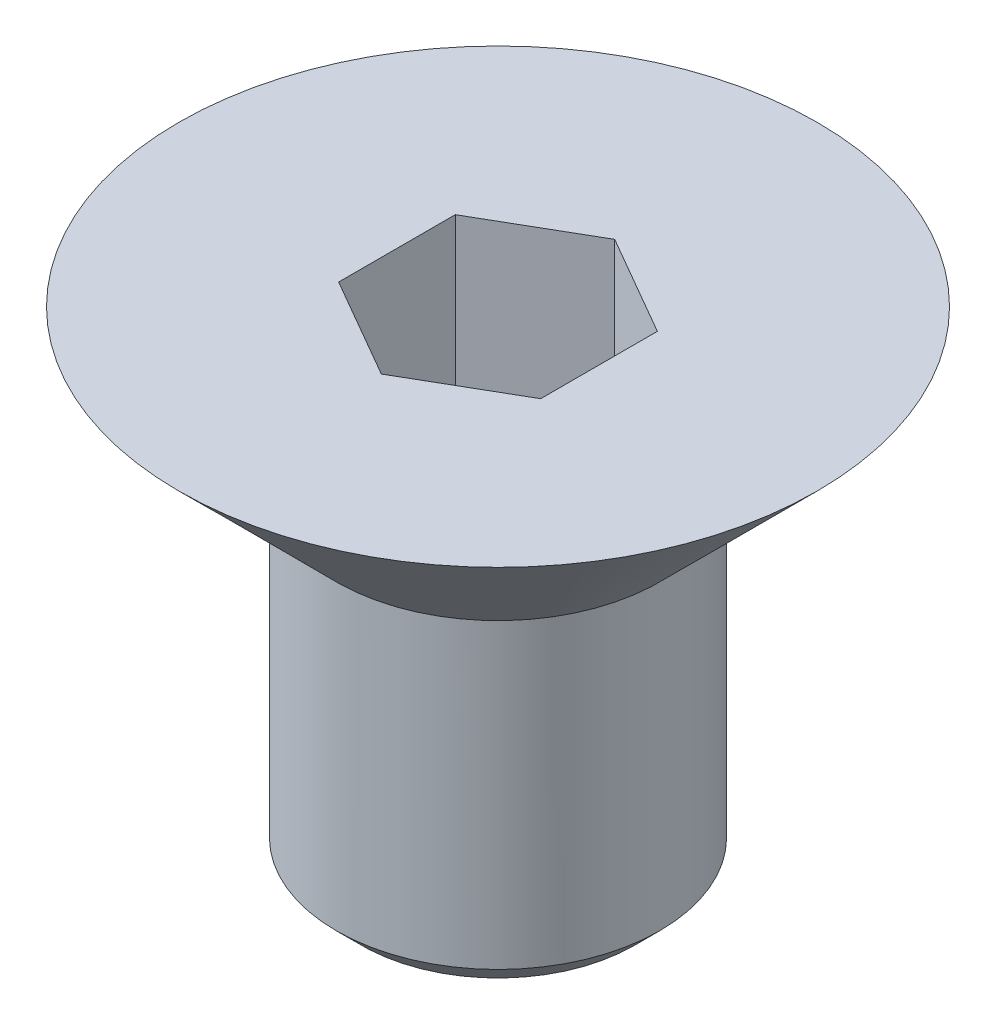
ISO-10303-21;
HEADER;
FILE_DESCRIPTION(('STEP AP214'),'2;1');
FILE_NAME('part.step','',(''),(''),'','','');
FILE_SCHEMA(('AUTOMOTIVE_DESIGN { 1 0 10303 214 1 1 1 1 }'));
ENDSEC;
DATA;
#1=APPLICATION_CONTEXT('core data for automotive mechanical design processes');
#2=APPLICATION_PROTOCOL_DEFINITION('international standard','automotive_design',2000,#1);
#3=PRODUCT_CONTEXT('',#1,'mechanical');
#4=PRODUCT('Part','Part','',(#3));
#5=PRODUCT_RELATED_PRODUCT_CATEGORY('part','',(#4));
#6=PRODUCT_DEFINITION_FORMATION('','',#4);
#7=PRODUCT_DEFINITION_CONTEXT('part definition',#1,'design');
#8=PRODUCT_DEFINITION('design','',#6,#7);
#9=PRODUCT_DEFINITION_SHAPE('','',#8);
#10=(LENGTH_UNIT() NAMED_UNIT(*) SI_UNIT(.MILLI.,.METRE.));
#11=(NAMED_UNIT(*) PLANE_ANGLE_UNIT() SI_UNIT($,.RADIAN.));
#12=(NAMED_UNIT(*) SI_UNIT($,.STERADIAN.) SOLID_ANGLE_UNIT());
#13=UNCERTAINTY_MEASURE_WITH_UNIT(LENGTH_MEASURE(1.E-05),#10,'distance_accuracy_value','');
#14=(GEOMETRIC_REPRESENTATION_CONTEXT(3) GLOBAL_UNCERTAINTY_ASSIGNED_CONTEXT((#13)) GLOBAL_UNIT_ASSIGNED_CONTEXT((#10,
#11,#12)) REPRESENTATION_CONTEXT('',''));
#15=CARTESIAN_POINT('',(0.,0.,0.));
#16=DIRECTION('',(0.,0.,1.));
#17=DIRECTION('',(1.,0.,0.));
#18=AXIS2_PLACEMENT_3D('',#15,#16,#17);
#19=CARTESIAN_POINT('',(0.,0.,0.));
#20=DIRECTION('',(0.,1.,0.));
#21=DIRECTION('',(-1.,0.,0.));
#22=AXIS2_PLACEMENT_3D('',#19,#20,#21);
#23=PLANE('',#22);
#24=DIRECTION('',(0.866025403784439,0.,-0.5));
#25=VECTOR('',#24,1.);
#26=CARTESIAN_POINT('',(0.,0.,2.88675134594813));
#27=LINE('',#26,#25);
#28=CARTESIAN_POINT('',(0.,0.,2.88675134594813));
#29=VERTEX_POINT('',#28);
#30=CARTESIAN_POINT('',(2.5,0.,1.44337567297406));
#31=VERTEX_POINT('',#30);
#32=EDGE_CURVE('E44',#29,#31,#27,.T.);
#33=ORIENTED_EDGE('',*,*,#32,.F.);
#34=DIRECTION('',(-0.866025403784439,0.,-0.5));
#35=VECTOR('',#34,1.);
#36=CARTESIAN_POINT('',(0.,0.,2.88675134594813));
#37=LINE('',#36,#35);
#38=CARTESIAN_POINT('',(-2.5,0.,1.44337567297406));
#39=VERTEX_POINT('',#38);
#40=EDGE_CURVE('E112',#29,#39,#37,.T.);
#41=ORIENTED_EDGE('',*,*,#40,.T.);
#42=DIRECTION('',(0.,0.,-1.));
#43=VECTOR('',#42,1.);
#44=CARTESIAN_POINT('',(-2.5,0.,1.44337567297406));
#45=LINE('',#44,#43);
#46=CARTESIAN_POINT('',(-2.5,0.,-1.44337567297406));
#47=VERTEX_POINT('',#46);
#48=EDGE_CURVE('E107',#39,#47,#45,.T.);
#49=ORIENTED_EDGE('',*,*,#48,.T.);
#50=DIRECTION('',(0.866025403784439,0.,-0.5));
#51=VECTOR('',#50,1.);
#52=CARTESIAN_POINT('',(-2.5,0.,-1.44337567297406));
#53=LINE('',#52,#51);
#54=CARTESIAN_POINT('',(0.,0.,-2.88675134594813));
#55=VERTEX_POINT('',#54);
#56=EDGE_CURVE('E105',#47,#55,#53,.T.);
#57=ORIENTED_EDGE('',*,*,#56,.T.);
#58=DIRECTION('',(-0.866025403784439,0.,-0.5));
#59=VECTOR('',#58,1.);
#60=CARTESIAN_POINT('',(2.5,0.,-1.44337567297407));
#61=LINE('',#60,#59);
#62=CARTESIAN_POINT('',(2.5,0.,-1.44337567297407));
#63=VERTEX_POINT('',#62);
#64=EDGE_CURVE('E87',#63,#55,#61,.T.);
#65=ORIENTED_EDGE('',*,*,#64,.F.);
#66=DIRECTION('',(0.,0.,-1.));
#67=VECTOR('',#66,1.);
#68=CARTESIAN_POINT('',(2.5,0.,1.44337567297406));
#69=LINE('',#68,#67);
#70=EDGE_CURVE('E98',#31,#63,#69,.T.);
#71=ORIENTED_EDGE('',*,*,#70,.F.);
#72=EDGE_LOOP('',(#33,#41,#49,#57,#65,#71));
#73=FACE_BOUND('',#72,.T.);
#74=CARTESIAN_POINT('',(0.,0.,0.));
#75=DIRECTION('',(0.,1.,0.));
#76=DIRECTION('',(-1.,0.,0.));
#77=AXIS2_PLACEMENT_3D('',#74,#75,#76);
#78=CIRCLE('',#77,7.89999999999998);
#79=CARTESIAN_POINT('',(-7.89999999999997,0.,0.));
#80=VERTEX_POINT('',#79);
#81=EDGE_CURVE('E137',#80,#80,#78,.T.);
#82=ORIENTED_EDGE('',*,*,#81,.T.);
#83=EDGE_LOOP('',(#82));
#84=FACE_BOUND('',#83,.T.);
#85=ADVANCED_FACE('F30',(#73,#84),#23,.T.);
#86=CARTESIAN_POINT('',(0.,0.,0.));
#87=DIRECTION('',(0.,1.,0.));
#88=DIRECTION('',(-1.,0.,0.));
#89=AXIS2_PLACEMENT_3D('',#86,#87,#88);
#90=CONICAL_SURFACE('',#89,7.89999999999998,0.78539816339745);
#91=CARTESIAN_POINT('',(0.,-3.89999999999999,0.));
#92=DIRECTION('',(0.,1.,0.));
#93=DIRECTION('',(-1.,0.,0.));
#94=AXIS2_PLACEMENT_3D('',#91,#92,#93);
#95=CIRCLE('',#94,3.99999999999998);
#96=CARTESIAN_POINT('',(-3.99999999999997,-3.89999999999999,0.));
#97=VERTEX_POINT('',#96);
#98=EDGE_CURVE('E128',#97,#97,#95,.T.);
#99=ORIENTED_EDGE('',*,*,#98,.T.);
#100=EDGE_LOOP('',(#99));
#101=FACE_BOUND('',#100,.T.);
#102=ORIENTED_EDGE('',*,*,#81,.F.);
#103=EDGE_LOOP('',(#102));
#104=FACE_BOUND('',#103,.T.);
#105=ADVANCED_FACE('F157',(#101,#104),#90,.T.);
#106=CARTESIAN_POINT('',(0.,65.1172922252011,0.));
#107=DIRECTION('',(0.,1.,0.));
#108=DIRECTION('',(-1.,0.,0.));
#109=AXIS2_PLACEMENT_3D('',#106,#107,#108);
#110=CYLINDRICAL_SURFACE('',#109,3.99999999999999);
#111=CARTESIAN_POINT('',(0.,-11.375,0.));
#112=DIRECTION('',(0.,-1.,0.));
#113=DIRECTION('',(1.,0.,0.));
#114=AXIS2_PLACEMENT_3D('',#111,#112,#113);
#115=CIRCLE('',#114,3.99999999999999);
#116=CARTESIAN_POINT('',(4.,-11.375,0.));
#117=VERTEX_POINT('',#116);
#118=EDGE_CURVE('E37',#117,#117,#115,.F.);
#119=ORIENTED_EDGE('',*,*,#118,.T.);
#120=EDGE_LOOP('',(#119));
#121=FACE_BOUND('',#120,.T.);
#122=ORIENTED_EDGE('',*,*,#98,.F.);
#123=EDGE_LOOP('',(#122));
#124=FACE_BOUND('',#123,.T.);
#125=ADVANCED_FACE('F142',(#121,#124),#110,.T.);
#126=CARTESIAN_POINT('',(4.00000000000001,-12.,0.));
#127=DIRECTION('',(0.,-1.,0.));
#128=DIRECTION('',(1.,0.,0.));
#129=AXIS2_PLACEMENT_3D('',#126,#127,#128);
#130=PLANE('',#129);
#131=CARTESIAN_POINT('',(0.,-12.,0.));
#132=DIRECTION('',(0.,-1.,0.));
#133=DIRECTION('',(1.,0.,0.));
#134=AXIS2_PLACEMENT_3D('',#131,#132,#133);
#135=CIRCLE('',#134,3.37499999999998);
#136=CARTESIAN_POINT('',(3.37499999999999,-12.,0.));
#137=VERTEX_POINT('',#136);
#138=EDGE_CURVE('E11',#137,#137,#135,.T.);
#139=ORIENTED_EDGE('',*,*,#138,.T.);
#140=EDGE_LOOP('',(#139));
#141=FACE_BOUND('',#140,.T.);
#142=ADVANCED_FACE('F165',(#141),#130,.T.);
#143=CARTESIAN_POINT('',(0.,-7.2,2.88675134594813));
#144=DIRECTION('',(0.5,0.,0.866025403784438));
#145=DIRECTION('',(0.866025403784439,0.,-0.5));
#146=AXIS2_PLACEMENT_3D('',#143,#144,#145);
#147=PLANE('',#146);
#148=ORIENTED_EDGE('',*,*,#32,.T.);
#149=DIRECTION('',(0.,1.,0.));
#150=VECTOR('',#149,1.);
#151=CARTESIAN_POINT('',(2.5,-7.2,1.44337567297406));
#152=LINE('',#151,#150);
#153=CARTESIAN_POINT('',(2.5,-7.2,1.44337567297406));
#154=VERTEX_POINT('',#153);
#155=EDGE_CURVE('E95',#154,#31,#152,.T.);
#156=ORIENTED_EDGE('',*,*,#155,.F.);
#157=DIRECTION('',(0.866025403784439,0.,-0.5));
#158=VECTOR('',#157,1.);
#159=CARTESIAN_POINT('',(0.,-7.2,2.88675134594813));
#160=LINE('',#159,#158);
#161=CARTESIAN_POINT('',(0.,-7.2,2.88675134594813));
#162=VERTEX_POINT('',#161);
#163=EDGE_CURVE('E115',#162,#154,#160,.T.);
#164=ORIENTED_EDGE('',*,*,#163,.F.);
#165=DIRECTION('',(0.,1.,0.));
#166=VECTOR('',#165,1.);
#167=CARTESIAN_POINT('',(0.,-7.2,2.88675134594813));
#168=LINE('',#167,#166);
#169=EDGE_CURVE('E51',#162,#29,#168,.T.);
#170=ORIENTED_EDGE('',*,*,#169,.T.);
#171=EDGE_LOOP('',(#148,#156,#164,#170));
#172=FACE_BOUND('',#171,.T.);
#173=ADVANCED_FACE('F171',(#172),#147,.F.);
#174=CARTESIAN_POINT('',(0.,-7.2,2.88675134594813));
#175=DIRECTION('',(0.5,0.,-0.866025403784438));
#176=DIRECTION('',(-0.866025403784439,0.,-0.5));
#177=AXIS2_PLACEMENT_3D('',#174,#175,#176);
#178=PLANE('',#177);
#179=ORIENTED_EDGE('',*,*,#40,.F.);
#180=ORIENTED_EDGE('',*,*,#169,.F.);
#181=DIRECTION('',(-0.866025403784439,0.,-0.5));
#182=VECTOR('',#181,1.);
#183=CARTESIAN_POINT('',(0.,-7.2,2.88675134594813));
#184=LINE('',#183,#182);
#185=CARTESIAN_POINT('',(-2.5,-7.2,1.44337567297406));
#186=VERTEX_POINT('',#185);
#187=EDGE_CURVE('E125',#162,#186,#184,.T.);
#188=ORIENTED_EDGE('',*,*,#187,.T.);
#189=DIRECTION('',(0.,1.,0.));
#190=VECTOR('',#189,1.);
#191=CARTESIAN_POINT('',(-2.5,-7.2,1.44337567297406));
#192=LINE('',#191,#190);
#193=EDGE_CURVE('E129',#186,#39,#192,.T.);
#194=ORIENTED_EDGE('',*,*,#193,.T.);
#195=EDGE_LOOP('',(#179,#180,#188,#194));
#196=FACE_BOUND('',#195,.T.);
#197=ADVANCED_FACE('F175',(#196),#178,.T.);
#198=CARTESIAN_POINT('',(-2.5,-7.2,1.44337567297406));
#199=DIRECTION('',(1.,0.,0.));
#200=DIRECTION('',(0.,1.,0.));
#201=AXIS2_PLACEMENT_3D('',#198,#199,#200);
#202=PLANE('',#201);
#203=ORIENTED_EDGE('',*,*,#48,.F.);
#204=ORIENTED_EDGE('',*,*,#193,.F.);
#205=DIRECTION('',(0.,0.,-1.));
#206=VECTOR('',#205,1.);
#207=CARTESIAN_POINT('',(-2.5,-7.2,1.44337567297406));
#208=LINE('',#207,#206);
#209=CARTESIAN_POINT('',(-2.5,-7.2,-1.44337567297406));
#210=VERTEX_POINT('',#209);
#211=EDGE_CURVE('E123',#186,#210,#208,.T.);
#212=ORIENTED_EDGE('',*,*,#211,.T.);
#213=DIRECTION('',(0.,1.,0.));
#214=VECTOR('',#213,1.);
#215=CARTESIAN_POINT('',(-2.5,-7.2,-1.44337567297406));
#216=LINE('',#215,#214);
#217=EDGE_CURVE('E131',#210,#47,#216,.T.);
#218=ORIENTED_EDGE('',*,*,#217,.T.);
#219=EDGE_LOOP('',(#203,#204,#212,#218));
#220=FACE_BOUND('',#219,.T.);
#221=ADVANCED_FACE('F183',(#220),#202,.T.);
#222=CARTESIAN_POINT('',(-2.5,-7.2,-1.44337567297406));
#223=DIRECTION('',(0.5,0.,0.866025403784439));
#224=DIRECTION('',(0.866025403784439,0.,-0.5));
#225=AXIS2_PLACEMENT_3D('',#222,#223,#224);
#226=PLANE('',#225);
#227=ORIENTED_EDGE('',*,*,#56,.F.);
#228=ORIENTED_EDGE('',*,*,#217,.F.);
#229=DIRECTION('',(0.866025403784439,0.,-0.5));
#230=VECTOR('',#229,1.);
#231=CARTESIAN_POINT('',(-2.5,-7.2,-1.44337567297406));
#232=LINE('',#231,#230);
#233=CARTESIAN_POINT('',(0.,-7.2,-2.88675134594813));
#234=VERTEX_POINT('',#233);
#235=EDGE_CURVE('E121',#210,#234,#232,.T.);
#236=ORIENTED_EDGE('',*,*,#235,.T.);
#237=DIRECTION('',(0.,1.,0.));
#238=VECTOR('',#237,1.);
#239=CARTESIAN_POINT('',(0.,-7.2,-2.88675134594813));
#240=LINE('',#239,#238);
#241=EDGE_CURVE('E94',#234,#55,#240,.T.);
#242=ORIENTED_EDGE('',*,*,#241,.T.);
#243=EDGE_LOOP('',(#227,#228,#236,#242));
#244=FACE_BOUND('',#243,.T.);
#245=ADVANCED_FACE('F180',(#244),#226,.T.);
#246=CARTESIAN_POINT('',(2.5,-7.2,-1.44337567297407));
#247=DIRECTION('',(0.5,0.,-0.866025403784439));
#248=DIRECTION('',(-0.866025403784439,0.,-0.5));
#249=AXIS2_PLACEMENT_3D('',#246,#247,#248);
#250=PLANE('',#249);
#251=ORIENTED_EDGE('',*,*,#64,.T.);
#252=ORIENTED_EDGE('',*,*,#241,.F.);
#253=DIRECTION('',(-0.866025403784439,0.,-0.5));
#254=VECTOR('',#253,1.);
#255=CARTESIAN_POINT('',(2.5,-7.2,-1.44337567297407));
#256=LINE('',#255,#254);
#257=CARTESIAN_POINT('',(2.5,-7.2,-1.44337567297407));
#258=VERTEX_POINT('',#257);
#259=EDGE_CURVE('E90',#258,#234,#256,.T.);
#260=ORIENTED_EDGE('',*,*,#259,.F.);
#261=DIRECTION('',(0.,1.,0.));
#262=VECTOR('',#261,1.);
#263=CARTESIAN_POINT('',(2.5,-7.2,-1.44337567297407));
#264=LINE('',#263,#262);
#265=EDGE_CURVE('E82',#258,#63,#264,.T.);
#266=ORIENTED_EDGE('',*,*,#265,.T.);
#267=EDGE_LOOP('',(#251,#252,#260,#266));
#268=FACE_BOUND('',#267,.T.);
#269=ADVANCED_FACE('F84',(#268),#250,.F.);
#270=CARTESIAN_POINT('',(2.5,-7.2,1.44337567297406));
#271=DIRECTION('',(1.,0.,0.));
#272=DIRECTION('',(0.,1.,0.));
#273=AXIS2_PLACEMENT_3D('',#270,#271,#272);
#274=PLANE('',#273);
#275=ORIENTED_EDGE('',*,*,#70,.T.);
#276=ORIENTED_EDGE('',*,*,#265,.F.);
#277=DIRECTION('',(0.,0.,-1.));
#278=VECTOR('',#277,1.);
#279=CARTESIAN_POINT('',(2.5,-7.2,1.44337567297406));
#280=LINE('',#279,#278);
#281=EDGE_CURVE('E118',#154,#258,#280,.T.);
#282=ORIENTED_EDGE('',*,*,#281,.F.);
#283=ORIENTED_EDGE('',*,*,#155,.T.);
#284=EDGE_LOOP('',(#275,#276,#282,#283));
#285=FACE_BOUND('',#284,.T.);
#286=ADVANCED_FACE('F99',(#285),#274,.F.);
#287=CARTESIAN_POINT('',(2.5,-7.2,1.44337567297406));
#288=DIRECTION('',(0.,1.,0.));
#289=DIRECTION('',(-1.,0.,0.));
#290=AXIS2_PLACEMENT_3D('',#287,#288,#289);
#291=PLANE('',#290);
#292=ORIENTED_EDGE('',*,*,#163,.T.);
#293=ORIENTED_EDGE('',*,*,#281,.T.);
#294=ORIENTED_EDGE('',*,*,#259,.T.);
#295=ORIENTED_EDGE('',*,*,#235,.F.);
#296=ORIENTED_EDGE('',*,*,#211,.F.);
#297=ORIENTED_EDGE('',*,*,#187,.F.);
#298=EDGE_LOOP('',(#292,#293,#294,#295,#296,#297));
#299=FACE_BOUND('',#298,.T.);
#300=ADVANCED_FACE('F147',(#299),#291,.T.);
#301=CARTESIAN_POINT('',(0.,-11.375,0.));
#302=DIRECTION('',(0.,1.,0.));
#303=DIRECTION('',(-1.,0.,0.));
#304=AXIS2_PLACEMENT_3D('',#301,#302,#303);
#305=CONICAL_SURFACE('',#304,3.99999999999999,0.785398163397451);
#306=ORIENTED_EDGE('',*,*,#138,.F.);
#307=EDGE_LOOP('',(#306));
#308=FACE_BOUND('',#307,.T.);
#309=ORIENTED_EDGE('',*,*,#118,.F.);
#310=EDGE_LOOP('',(#309));
#311=FACE_BOUND('',#310,.T.);
#312=ADVANCED_FACE('F145',(#308,#311),#305,.T.);
#313=CLOSED_SHELL('',(#85,#105,#125,#142,#173,#197,#221,#245,#269,#286,#300,#312));
#314=MANIFOLD_SOLID_BREP('B2',#313);
#315=ADVANCED_BREP_SHAPE_REPRESENTATION('',(#18,#314),#14);
#316=SHAPE_DEFINITION_REPRESENTATION(#9,#315);
ENDSEC;
END-ISO-10303-21;
